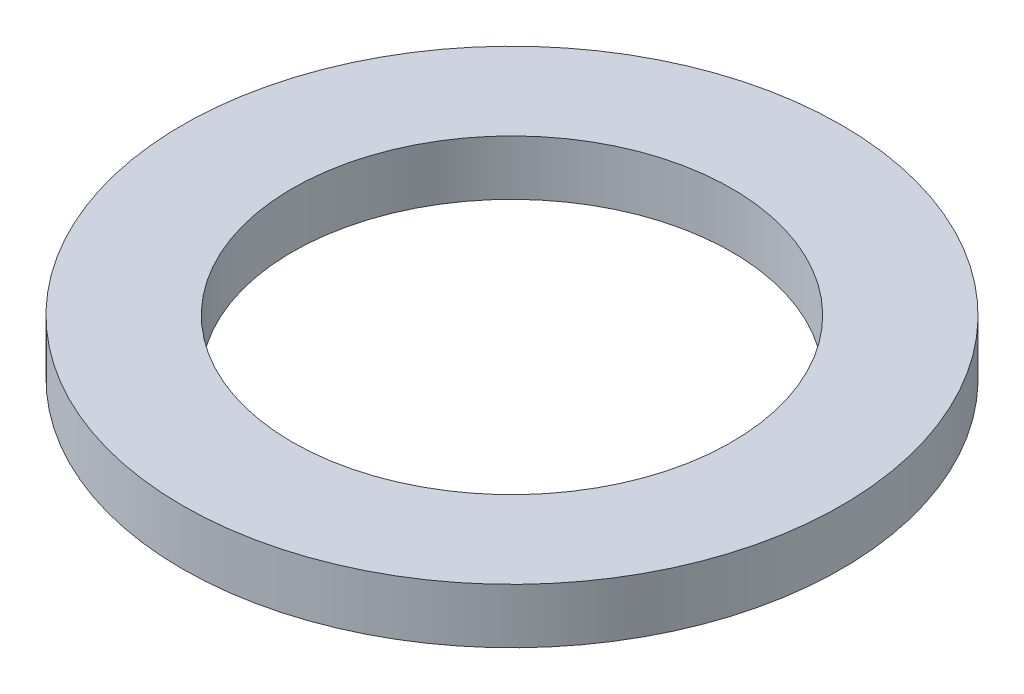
ISO-10303-21;
HEADER;
FILE_DESCRIPTION(('STEP AP214'),'2;1');
FILE_NAME('part.step','',(''),(''),'','','');
FILE_SCHEMA(('AUTOMOTIVE_DESIGN { 1 0 10303 214 1 1 1 1 }'));
ENDSEC;
DATA;
#1=APPLICATION_CONTEXT('core data for automotive mechanical design processes');
#2=APPLICATION_PROTOCOL_DEFINITION('international standard','automotive_design',2000,#1);
#3=PRODUCT_CONTEXT('',#1,'mechanical');
#4=PRODUCT('Part','Part','',(#3));
#5=PRODUCT_RELATED_PRODUCT_CATEGORY('part','',(#4));
#6=PRODUCT_DEFINITION_FORMATION('','',#4);
#7=PRODUCT_DEFINITION_CONTEXT('part definition',#1,'design');
#8=PRODUCT_DEFINITION('design','',#6,#7);
#9=PRODUCT_DEFINITION_SHAPE('','',#8);
#10=(LENGTH_UNIT() NAMED_UNIT(*) SI_UNIT(.MILLI.,.METRE.));
#11=(NAMED_UNIT(*) PLANE_ANGLE_UNIT() SI_UNIT($,.RADIAN.));
#12=(NAMED_UNIT(*) SI_UNIT($,.STERADIAN.) SOLID_ANGLE_UNIT());
#13=UNCERTAINTY_MEASURE_WITH_UNIT(LENGTH_MEASURE(1.E-05),#10,'distance_accuracy_value','');
#14=(GEOMETRIC_REPRESENTATION_CONTEXT(3) GLOBAL_UNCERTAINTY_ASSIGNED_CONTEXT((#13)) GLOBAL_UNIT_ASSIGNED_CONTEXT((#10,
#11,#12)) REPRESENTATION_CONTEXT('',''));
#15=CARTESIAN_POINT('',(0.,0.,0.));
#16=DIRECTION('',(0.,0.,1.));
#17=DIRECTION('',(1.,0.,0.));
#18=AXIS2_PLACEMENT_3D('',#15,#16,#17);
#19=CARTESIAN_POINT('',(0.,5.,0.));
#20=DIRECTION('',(0.,1.,0.));
#21=DIRECTION('',(0.,0.,1.));
#22=AXIS2_PLACEMENT_3D('',#19,#20,#21);
#23=PLANE('',#22);
#24=CARTESIAN_POINT('',(0.,5.,0.));
#25=DIRECTION('',(0.,1.,0.));
#26=DIRECTION('',(0.,0.,1.));
#27=AXIS2_PLACEMENT_3D('',#24,#25,#26);
#28=CIRCLE('',#27,30.);
#29=CARTESIAN_POINT('',(0.,5.,30.));
#30=VERTEX_POINT('',#29);
#31=EDGE_CURVE('E10',#30,#30,#28,.T.);
#32=ORIENTED_EDGE('',*,*,#31,.T.);
#33=EDGE_LOOP('',(#32));
#34=FACE_BOUND('',#33,.T.);
#35=CARTESIAN_POINT('',(0.,5.,0.));
#36=DIRECTION('',(0.,1.,0.));
#37=DIRECTION('',(0.,0.,1.));
#38=AXIS2_PLACEMENT_3D('',#35,#36,#37);
#39=CIRCLE('',#38,20.);
#40=CARTESIAN_POINT('',(0.,5.,20.));
#41=VERTEX_POINT('',#40);
#42=EDGE_CURVE('E43',#41,#41,#39,.T.);
#43=ORIENTED_EDGE('',*,*,#42,.F.);
#44=EDGE_LOOP('',(#43));
#45=FACE_BOUND('',#44,.T.);
#46=ADVANCED_FACE('F32',(#34,#45),#23,.T.);
#47=CARTESIAN_POINT('',(0.,0.,0.));
#48=DIRECTION('',(0.,1.,0.));
#49=DIRECTION('',(0.,0.,1.));
#50=AXIS2_PLACEMENT_3D('',#47,#48,#49);
#51=PLANE('',#50);
#52=CARTESIAN_POINT('',(0.,0.,0.));
#53=DIRECTION('',(0.,1.,0.));
#54=DIRECTION('',(0.,0.,1.));
#55=AXIS2_PLACEMENT_3D('',#52,#53,#54);
#56=CIRCLE('',#55,30.);
#57=CARTESIAN_POINT('',(0.,0.,30.));
#58=VERTEX_POINT('',#57);
#59=EDGE_CURVE('E36',#58,#58,#56,.T.);
#60=ORIENTED_EDGE('',*,*,#59,.F.);
#61=EDGE_LOOP('',(#60));
#62=FACE_BOUND('',#61,.T.);
#63=CARTESIAN_POINT('',(0.,0.,0.));
#64=DIRECTION('',(0.,1.,0.));
#65=DIRECTION('',(0.,0.,1.));
#66=AXIS2_PLACEMENT_3D('',#63,#64,#65);
#67=CIRCLE('',#66,20.);
#68=CARTESIAN_POINT('',(0.,0.,20.));
#69=VERTEX_POINT('',#68);
#70=EDGE_CURVE('E45',#69,#69,#67,.T.);
#71=ORIENTED_EDGE('',*,*,#70,.T.);
#72=EDGE_LOOP('',(#71));
#73=FACE_BOUND('',#72,.T.);
#74=ADVANCED_FACE('F55',(#62,#73),#51,.F.);
#75=CARTESIAN_POINT('',(0.,5.,0.));
#76=DIRECTION('',(0.,-1.,0.));
#77=DIRECTION('',(0.,0.,-1.));
#78=AXIS2_PLACEMENT_3D('',#75,#76,#77);
#79=CYLINDRICAL_SURFACE('',#78,30.);
#80=ORIENTED_EDGE('',*,*,#31,.F.);
#81=EDGE_LOOP('',(#80));
#82=FACE_BOUND('',#81,.T.);
#83=ORIENTED_EDGE('',*,*,#59,.T.);
#84=EDGE_LOOP('',(#83));
#85=FACE_BOUND('',#84,.T.);
#86=ADVANCED_FACE('F34',(#82,#85),#79,.T.);
#87=CARTESIAN_POINT('',(0.,5.,0.));
#88=DIRECTION('',(0.,-1.,0.));
#89=DIRECTION('',(0.,0.,-1.));
#90=AXIS2_PLACEMENT_3D('',#87,#88,#89);
#91=CYLINDRICAL_SURFACE('',#90,20.);
#92=ORIENTED_EDGE('',*,*,#42,.T.);
#93=EDGE_LOOP('',(#92));
#94=FACE_BOUND('',#93,.T.);
#95=ORIENTED_EDGE('',*,*,#70,.F.);
#96=EDGE_LOOP('',(#95));
#97=FACE_BOUND('',#96,.T.);
#98=ADVANCED_FACE('F51',(#94,#97),#91,.F.);
#99=CLOSED_SHELL('',(#46,#74,#86,#98));
#100=MANIFOLD_SOLID_BREP('B2',#99);
#101=ADVANCED_BREP_SHAPE_REPRESENTATION('',(#18,#100),#14);
#102=SHAPE_DEFINITION_REPRESENTATION(#9,#101);
ENDSEC;
END-ISO-10303-21;
